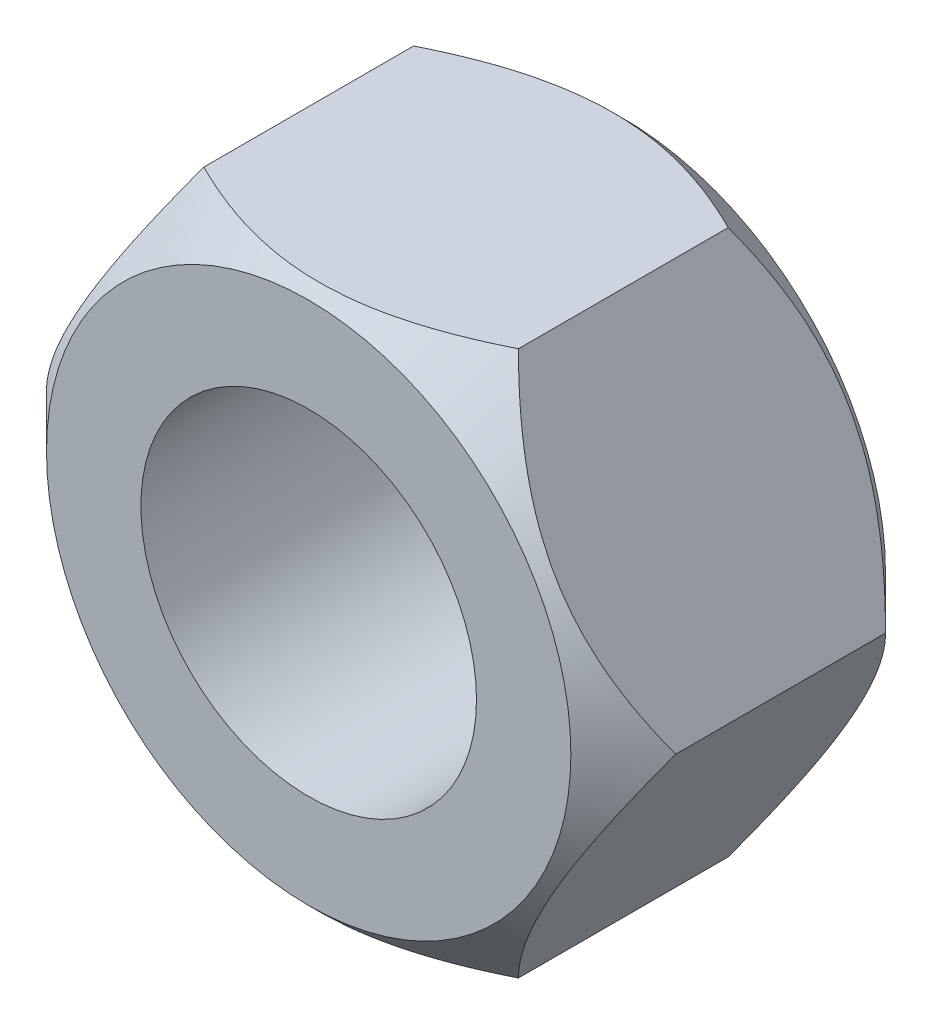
from build123d import *

# Parameters (mm, degrees)
ESQUISSE1_R             = 3
BOSS_EXTRU_2_DEPTH      = 3
CHANFREIN1_SIZE         = 0.5
ESQUISSE3_R             = 1.6
ENL_V_MAT_EXTRU_2_DEPTH = 6.196152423
ENL_V_MAT_EXTRU_3_DEPTH = 6.196152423


with BuildPart() as part:
    # Esquisse1 → Boss.-Extru.2 (new body)
    with BuildSketch(Plane.XY):
        Circle(ESQUISSE1_R)
    extrude(amount=BOSS_EXTRU_2_DEPTH)

    # Chanfrein1
    chanfrein1_edges = [part.edges().sort_by_distance(p)[0] for p in [
        (-3, 0, 0),
        (-3, 0, 3),
    ]]
    chamfer(chanfrein1_edges, length=CHANFREIN1_SIZE)

    # Esquisse3 → Enl_v. mat.-Extru.2 (cut, through all)
    with BuildSketch(Plane.XY.offset(3)):
        Circle(ESQUISSE3_R)
    extrude(amount=-ENL_V_MAT_EXTRU_2_DEPTH, mode=Mode.SUBTRACT)

    # Esquisse4 → Enl_v. mat.-Extru.3 (cut, through all)
    with BuildSketch(Plane.XY.offset(3)):
        with BuildLine():
            ThreePointArc((-3, 0), (-2.598076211, 1.5), (-1.5, 2.598076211))
            Line((-1.5, 2.598076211), (-3, 0))
        make_face()
        with BuildLine():
            ThreePointArc((-1.5, 2.598076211), (0, 3), (1.5, 2.598076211))
            Line((1.5, 2.598076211), (-1.5, 2.598076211))
        make_face()
        with BuildLine():
            ThreePointArc((1.5, 2.598076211), (2.598076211, 1.5), (3, 0))
            Line((3, 0), (1.5, 2.598076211))
        make_face()
        with BuildLine():
            ThreePointArc((3, 0), (2.598076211, -1.5), (1.5, -2.598076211))
            Line((1.5, -2.598076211), (3, 0))
        make_face()
        with BuildLine():
            ThreePointArc((1.5, -2.598076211), (0, -3), (-1.5, -2.598076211))
            Line((-1.5, -2.598076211), (1.5, -2.598076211))
        make_face()
        with BuildLine():
            ThreePointArc((-1.5, -2.598076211), (-2.598076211, -1.5), (-3, 0))
            Line((-3, 0), (-1.5, -2.598076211))
        make_face()
    extrude(amount=-ENL_V_MAT_EXTRU_3_DEPTH, mode=Mode.SUBTRACT)


solid = part.part
